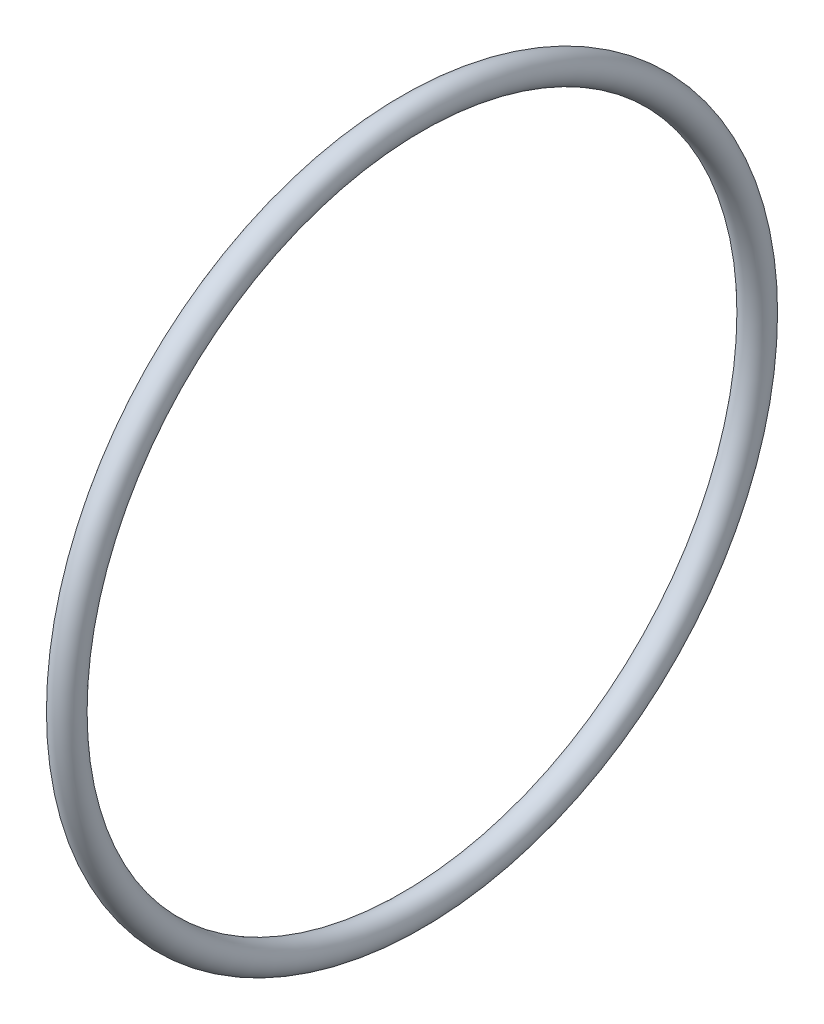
from build123d import *

# Parameters (mm, degrees)
ESQUISSE1_R = 1


with BuildPart() as part:
    # Esquisse1 → Base-R_volution (revolve)
    with BuildSketch(Plane.XY, mode=Mode.PRIVATE) as base_r_volution_sk:
        with Locations((0, 24)):
            Circle(ESQUISSE1_R)
    revolve(base_r_volution_sk.sketch.rotate(Axis((-70, 0, 0), (1, 0, 0)), 90), axis=Axis((-70, 0, 0), (1, 0, 0)))


solid = part.part
